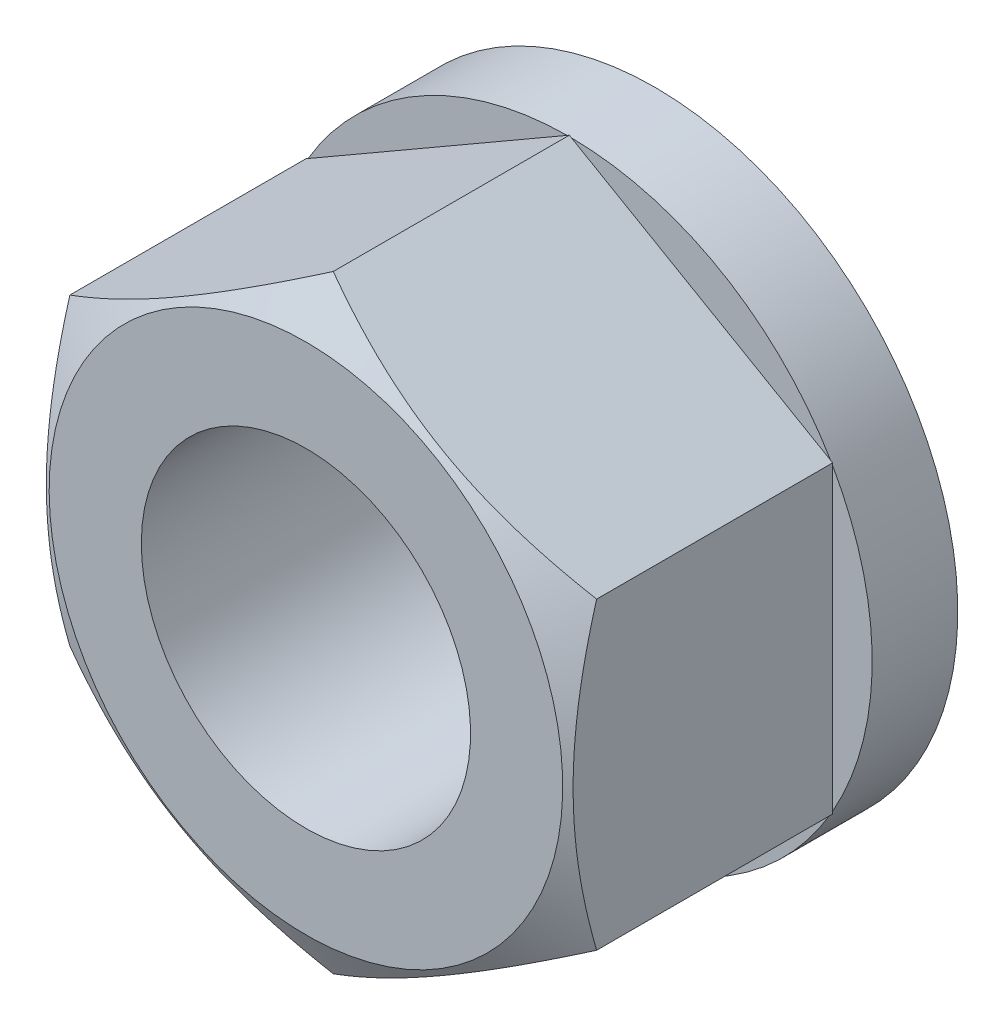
ISO-10303-21;
HEADER;
FILE_DESCRIPTION(('STEP AP214'),'2;1');
FILE_NAME('part.step','',(''),(''),'','','');
FILE_SCHEMA(('AUTOMOTIVE_DESIGN { 1 0 10303 214 1 1 1 1 }'));
ENDSEC;
DATA;
#1=APPLICATION_CONTEXT('core data for automotive mechanical design processes');
#2=APPLICATION_PROTOCOL_DEFINITION('international standard','automotive_design',2000,#1);
#3=PRODUCT_CONTEXT('',#1,'mechanical');
#4=PRODUCT('Part','Part','',(#3));
#5=PRODUCT_RELATED_PRODUCT_CATEGORY('part','',(#4));
#6=PRODUCT_DEFINITION_FORMATION('','',#4);
#7=PRODUCT_DEFINITION_CONTEXT('part definition',#1,'design');
#8=PRODUCT_DEFINITION('design','',#6,#7);
#9=PRODUCT_DEFINITION_SHAPE('','',#8);
#10=(LENGTH_UNIT() NAMED_UNIT(*) SI_UNIT(.MILLI.,.METRE.));
#11=(NAMED_UNIT(*) PLANE_ANGLE_UNIT() SI_UNIT($,.RADIAN.));
#12=(NAMED_UNIT(*) SI_UNIT($,.STERADIAN.) SOLID_ANGLE_UNIT());
#13=UNCERTAINTY_MEASURE_WITH_UNIT(LENGTH_MEASURE(1.E-05),#10,'distance_accuracy_value','');
#14=(GEOMETRIC_REPRESENTATION_CONTEXT(3) GLOBAL_UNCERTAINTY_ASSIGNED_CONTEXT((#13)) GLOBAL_UNIT_ASSIGNED_CONTEXT((#10,
#11,#12)) REPRESENTATION_CONTEXT('',''));
#15=CARTESIAN_POINT('',(0.,0.,0.));
#16=DIRECTION('',(0.,0.,1.));
#17=DIRECTION('',(1.,0.,0.));
#18=AXIS2_PLACEMENT_3D('',#15,#16,#17);
#19=CARTESIAN_POINT('',(0.,0.,1.3));
#20=DIRECTION('',(0.,0.,1.));
#21=DIRECTION('',(0.866025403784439,-0.5,0.));
#22=AXIS2_PLACEMENT_3D('',#19,#20,#21);
#23=PLANE('',#22);
#24=DIRECTION('',(0.866025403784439,0.5,0.));
#25=VECTOR('',#24,1.);
#26=CARTESIAN_POINT('',(0.,-4.61880215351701,1.3));
#27=LINE('',#26,#25);
#28=CARTESIAN_POINT('',(0.0327684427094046,-4.59988328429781,1.3));
#29=VERTEX_POINT('',#28);
#30=CARTESIAN_POINT('',(3.9672315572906,-2.3283199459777,1.3));
#31=VERTEX_POINT('',#30);
#32=EDGE_CURVE('E28',#29,#31,#27,.T.);
#33=ORIENTED_EDGE('',*,*,#32,.F.);
#34=CARTESIAN_POINT('',(0.,0.,1.3));
#35=DIRECTION('',(0.,0.,1.));
#36=DIRECTION('',(0.866025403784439,-0.5,0.));
#37=AXIS2_PLACEMENT_3D('',#34,#35,#36);
#38=CIRCLE('',#37,4.6);
#39=EDGE_CURVE('E163',#29,#31,#38,.T.);
#40=ORIENTED_EDGE('',*,*,#39,.T.);
#41=EDGE_LOOP('',(#33,#40));
#42=FACE_BOUND('',#41,.T.);
#43=ADVANCED_FACE('F14',(#42),#23,.T.);
#44=DIRECTION('',(0.866025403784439,-0.5,0.));
#45=VECTOR('',#44,1.);
#46=CARTESIAN_POINT('',(-4.,-2.3094010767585,1.3));
#47=LINE('',#46,#45);
#48=CARTESIAN_POINT('',(-3.9672315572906,-2.3283199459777,1.3));
#49=VERTEX_POINT('',#48);
#50=CARTESIAN_POINT('',(-0.0327684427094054,-4.59988328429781,1.3));
#51=VERTEX_POINT('',#50);
#52=EDGE_CURVE('E137',#49,#51,#47,.T.);
#53=ORIENTED_EDGE('',*,*,#52,.F.);
#54=EDGE_CURVE('E171',#49,#51,#38,.T.);
#55=ORIENTED_EDGE('',*,*,#54,.T.);
#56=EDGE_LOOP('',(#53,#55));
#57=FACE_BOUND('',#56,.T.);
#58=ADVANCED_FACE('F299',(#57),#23,.T.);
#59=DIRECTION('',(0.,-1.,0.));
#60=VECTOR('',#59,1.);
#61=CARTESIAN_POINT('',(-4.,2.30940107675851,1.3));
#62=LINE('',#61,#60);
#63=CARTESIAN_POINT('',(-4.,2.2715633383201,1.3));
#64=VERTEX_POINT('',#63);
#65=CARTESIAN_POINT('',(-4.,-2.2715633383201,1.3));
#66=VERTEX_POINT('',#65);
#67=EDGE_CURVE('E219',#64,#66,#62,.T.);
#68=ORIENTED_EDGE('',*,*,#67,.F.);
#69=EDGE_CURVE('E178',#64,#66,#38,.T.);
#70=ORIENTED_EDGE('',*,*,#69,.T.);
#71=EDGE_LOOP('',(#68,#70));
#72=FACE_BOUND('',#71,.T.);
#73=ADVANCED_FACE('F305',(#72),#23,.T.);
#74=DIRECTION('',(-0.866025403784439,-0.5,0.));
#75=VECTOR('',#74,1.);
#76=CARTESIAN_POINT('',(0.,4.61880215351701,1.3));
#77=LINE('',#76,#75);
#78=CARTESIAN_POINT('',(-0.0327684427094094,4.59988328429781,1.3));
#79=VERTEX_POINT('',#78);
#80=CARTESIAN_POINT('',(-3.9672315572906,2.3283199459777,1.3));
#81=VERTEX_POINT('',#80);
#82=EDGE_CURVE('E217',#79,#81,#77,.T.);
#83=ORIENTED_EDGE('',*,*,#82,.F.);
#84=EDGE_CURVE('E187',#79,#81,#38,.T.);
#85=ORIENTED_EDGE('',*,*,#84,.T.);
#86=EDGE_LOOP('',(#83,#85));
#87=FACE_BOUND('',#86,.T.);
#88=ADVANCED_FACE('F315',(#87),#23,.T.);
#89=DIRECTION('',(-0.866025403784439,0.5,0.));
#90=VECTOR('',#89,1.);
#91=CARTESIAN_POINT('',(4.,2.3094010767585,1.3));
#92=LINE('',#91,#90);
#93=CARTESIAN_POINT('',(3.9672315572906,2.3283199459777,1.3));
#94=VERTEX_POINT('',#93);
#95=CARTESIAN_POINT('',(0.0327684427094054,4.59988328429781,1.3));
#96=VERTEX_POINT('',#95);
#97=EDGE_CURVE('E157',#94,#96,#92,.T.);
#98=ORIENTED_EDGE('',*,*,#97,.F.);
#99=EDGE_CURVE('E162',#94,#96,#38,.T.);
#100=ORIENTED_EDGE('',*,*,#99,.T.);
#101=EDGE_LOOP('',(#98,#100));
#102=FACE_BOUND('',#101,.T.);
#103=ADVANCED_FACE('F204',(#102),#23,.T.);
#104=DIRECTION('',(0.,1.,0.));
#105=VECTOR('',#104,1.);
#106=CARTESIAN_POINT('',(4.,-2.30940107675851,1.3));
#107=LINE('',#106,#105);
#108=CARTESIAN_POINT('',(4.,-2.27156333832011,1.3));
#109=VERTEX_POINT('',#108);
#110=CARTESIAN_POINT('',(4.,2.2715633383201,1.3));
#111=VERTEX_POINT('',#110);
#112=EDGE_CURVE('E152',#109,#111,#107,.T.);
#113=ORIENTED_EDGE('',*,*,#112,.F.);
#114=EDGE_CURVE('E151',#109,#111,#38,.T.);
#115=ORIENTED_EDGE('',*,*,#114,.T.);
#116=EDGE_LOOP('',(#113,#115));
#117=FACE_BOUND('',#116,.T.);
#118=ADVANCED_FACE('F300',(#117),#23,.T.);
#119=CARTESIAN_POINT('',(0.,0.,0.));
#120=DIRECTION('',(0.,0.,1.));
#121=DIRECTION('',(0.866025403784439,-0.5,0.));
#122=AXIS2_PLACEMENT_3D('',#119,#120,#121);
#123=PLANE('',#122);
#124=CARTESIAN_POINT('',(0.,0.,0.));
#125=DIRECTION('',(0.,0.,1.));
#126=DIRECTION('',(0.866025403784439,-0.5,0.));
#127=AXIS2_PLACEMENT_3D('',#124,#125,#126);
#128=CIRCLE('',#127,4.6);
#129=CARTESIAN_POINT('',(3.98371685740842,-2.3,0.));
#130=VERTEX_POINT('',#129);
#131=EDGE_CURVE('E149',#130,#130,#128,.T.);
#132=ORIENTED_EDGE('',*,*,#131,.F.);
#133=EDGE_LOOP('',(#132));
#134=FACE_BOUND('',#133,.T.);
#135=CARTESIAN_POINT('',(0.,0.,0.));
#136=DIRECTION('',(0.,0.,1.));
#137=DIRECTION('',(0.866025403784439,-0.5,0.));
#138=AXIS2_PLACEMENT_3D('',#135,#136,#137);
#139=CIRCLE('',#138,2.5);
#140=CARTESIAN_POINT('',(2.1650635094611,-1.25,0.));
#141=VERTEX_POINT('',#140);
#142=EDGE_CURVE('E146',#141,#141,#139,.T.);
#143=ORIENTED_EDGE('',*,*,#142,.T.);
#144=EDGE_LOOP('',(#143));
#145=FACE_BOUND('',#144,.T.);
#146=ADVANCED_FACE('F308',(#134,#145),#123,.F.);
#147=CARTESIAN_POINT('',(0.,0.,1.3));
#148=DIRECTION('',(0.,0.,-1.));
#149=DIRECTION('',(-0.866025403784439,0.5,0.));
#150=AXIS2_PLACEMENT_3D('',#147,#148,#149);
#151=CYLINDRICAL_SURFACE('',#150,4.6);
#152=ORIENTED_EDGE('',*,*,#114,.F.);
#153=EDGE_CURVE('E42',#31,#109,#38,.T.);
#154=ORIENTED_EDGE('',*,*,#153,.F.);
#155=ORIENTED_EDGE('',*,*,#39,.F.);
#156=EDGE_CURVE('E168',#51,#29,#38,.T.);
#157=ORIENTED_EDGE('',*,*,#156,.F.);
#158=ORIENTED_EDGE('',*,*,#54,.F.);
#159=EDGE_CURVE('E174',#66,#49,#38,.T.);
#160=ORIENTED_EDGE('',*,*,#159,.F.);
#161=ORIENTED_EDGE('',*,*,#69,.F.);
#162=EDGE_CURVE('E183',#81,#64,#38,.T.);
#163=ORIENTED_EDGE('',*,*,#162,.F.);
#164=ORIENTED_EDGE('',*,*,#84,.F.);
#165=EDGE_CURVE('E193',#96,#79,#38,.T.);
#166=ORIENTED_EDGE('',*,*,#165,.F.);
#167=ORIENTED_EDGE('',*,*,#99,.F.);
#168=EDGE_CURVE('E153',#111,#94,#38,.T.);
#169=ORIENTED_EDGE('',*,*,#168,.F.);
#170=EDGE_LOOP('',(#152,#154,#155,#157,#158,#160,#161,#163,#164,#166,#167,#169));
#171=FACE_BOUND('',#170,.T.);
#172=ORIENTED_EDGE('',*,*,#131,.T.);
#173=EDGE_LOOP('',(#172));
#174=FACE_BOUND('',#173,.T.);
#175=ADVANCED_FACE('F16',(#171,#174),#151,.T.);
#176=CARTESIAN_POINT('',(0.,0.,1.3));
#177=DIRECTION('',(0.,0.,-1.));
#178=DIRECTION('',(-0.866025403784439,0.5,0.));
#179=AXIS2_PLACEMENT_3D('',#176,#177,#178);
#180=CYLINDRICAL_SURFACE('',#179,2.5);
#181=ORIENTED_EDGE('',*,*,#142,.F.);
#182=EDGE_LOOP('',(#181));
#183=FACE_BOUND('',#182,.T.);
#184=CARTESIAN_POINT('',(0.,0.,5.3));
#185=DIRECTION('',(0.,0.,1.));
#186=DIRECTION('',(0.866025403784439,-0.5,0.));
#187=AXIS2_PLACEMENT_3D('',#184,#185,#186);
#188=CIRCLE('',#187,2.5);
#189=CARTESIAN_POINT('',(2.1650635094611,-1.25,5.3));
#190=VERTEX_POINT('',#189);
#191=EDGE_CURVE('E122',#190,#190,#188,.T.);
#192=ORIENTED_EDGE('',*,*,#191,.T.);
#193=EDGE_LOOP('',(#192));
#194=FACE_BOUND('',#193,.T.);
#195=ADVANCED_FACE('F330',(#183,#194),#180,.F.);
#196=CARTESIAN_POINT('',(0.,-4.61880215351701,1.3));
#197=DIRECTION('',(0.,0.,-1.));
#198=DIRECTION('',(-0.866025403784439,0.5,0.));
#199=AXIS2_PLACEMENT_3D('',#196,#197,#198);
#200=PLANE('',#199);
#201=CARTESIAN_POINT('',(4.,2.3094010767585,1.3));
#202=VERTEX_POINT('',#201);
#203=EDGE_CURVE('E160',#111,#202,#107,.T.);
#204=ORIENTED_EDGE('',*,*,#203,.F.);
#205=ORIENTED_EDGE('',*,*,#168,.T.);
#206=EDGE_CURVE('E212',#202,#94,#92,.T.);
#207=ORIENTED_EDGE('',*,*,#206,.F.);
#208=EDGE_LOOP('',(#204,#205,#207));
#209=FACE_BOUND('',#208,.T.);
#210=ADVANCED_FACE('F320',(#209),#200,.T.);
#211=CARTESIAN_POINT('',(0.,4.61880215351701,1.3));
#212=VERTEX_POINT('',#211);
#213=EDGE_CURVE('E207',#96,#212,#92,.T.);
#214=ORIENTED_EDGE('',*,*,#213,.F.);
#215=ORIENTED_EDGE('',*,*,#165,.T.);
#216=EDGE_CURVE('E209',#212,#79,#77,.T.);
#217=ORIENTED_EDGE('',*,*,#216,.F.);
#218=EDGE_LOOP('',(#214,#215,#217));
#219=FACE_BOUND('',#218,.T.);
#220=ADVANCED_FACE('F208',(#219),#200,.T.);
#221=CARTESIAN_POINT('',(-4.,2.30940107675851,1.3));
#222=VERTEX_POINT('',#221);
#223=EDGE_CURVE('E221',#81,#222,#77,.T.);
#224=ORIENTED_EDGE('',*,*,#223,.F.);
#225=ORIENTED_EDGE('',*,*,#162,.T.);
#226=EDGE_CURVE('E226',#222,#64,#62,.T.);
#227=ORIENTED_EDGE('',*,*,#226,.F.);
#228=EDGE_LOOP('',(#224,#225,#227));
#229=FACE_BOUND('',#228,.T.);
#230=ADVANCED_FACE('F337',(#229),#200,.T.);
#231=CARTESIAN_POINT('',(-4.,-2.3094010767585,1.3));
#232=VERTEX_POINT('',#231);
#233=EDGE_CURVE('E225',#66,#232,#62,.T.);
#234=ORIENTED_EDGE('',*,*,#233,.F.);
#235=ORIENTED_EDGE('',*,*,#159,.T.);
#236=EDGE_CURVE('E131',#232,#49,#47,.T.);
#237=ORIENTED_EDGE('',*,*,#236,.F.);
#238=EDGE_LOOP('',(#234,#235,#237));
#239=FACE_BOUND('',#238,.T.);
#240=ADVANCED_FACE('F332',(#239),#200,.T.);
#241=CARTESIAN_POINT('',(0.,-4.61880215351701,1.3));
#242=VERTEX_POINT('',#241);
#243=EDGE_CURVE('E128',#51,#242,#47,.T.);
#244=ORIENTED_EDGE('',*,*,#243,.F.);
#245=ORIENTED_EDGE('',*,*,#156,.T.);
#246=EDGE_CURVE('E232',#242,#29,#27,.T.);
#247=ORIENTED_EDGE('',*,*,#246,.F.);
#248=EDGE_LOOP('',(#244,#245,#247));
#249=FACE_BOUND('',#248,.T.);
#250=ADVANCED_FACE('F323',(#249),#200,.T.);
#251=CARTESIAN_POINT('',(0.,-4.61880215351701,5.3));
#252=DIRECTION('',(0.,0.,-1.));
#253=DIRECTION('',(-0.866025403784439,0.5,0.));
#254=AXIS2_PLACEMENT_3D('',#251,#252,#253);
#255=PLANE('',#254);
#256=CARTESIAN_POINT('',(0.,0.,5.3));
#257=DIRECTION('',(0.,0.,-1.));
#258=DIRECTION('',(-0.866025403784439,0.5,0.));
#259=AXIS2_PLACEMENT_3D('',#256,#257,#258);
#260=CIRCLE('',#259,3.9);
#261=CARTESIAN_POINT('',(-3.37749907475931,1.95,5.3));
#262=VERTEX_POINT('',#261);
#263=EDGE_CURVE('E343',#262,#262,#260,.T.);
#264=ORIENTED_EDGE('',*,*,#263,.F.);
#265=EDGE_LOOP('',(#264));
#266=FACE_BOUND('',#265,.T.);
#267=ORIENTED_EDGE('',*,*,#191,.F.);
#268=EDGE_LOOP('',(#267));
#269=FACE_BOUND('',#268,.T.);
#270=ADVANCED_FACE('F322',(#266,#269),#255,.F.);
#271=CARTESIAN_POINT('',(4.,-2.30940107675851,1.3));
#272=VERTEX_POINT('',#271);
#273=EDGE_CURVE('E233',#31,#272,#27,.T.);
#274=ORIENTED_EDGE('',*,*,#273,.F.);
#275=ORIENTED_EDGE('',*,*,#153,.T.);
#276=EDGE_CURVE('E159',#272,#109,#107,.T.);
#277=ORIENTED_EDGE('',*,*,#276,.F.);
#278=EDGE_LOOP('',(#274,#275,#277));
#279=FACE_BOUND('',#278,.T.);
#280=ADVANCED_FACE('F256',(#279),#200,.T.);
#281=CARTESIAN_POINT('',(0.,-4.61880215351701,5.3));
#282=DIRECTION('',(-0.5,0.866025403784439,0.));
#283=DIRECTION('',(-0.866025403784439,-0.5,0.));
#284=AXIS2_PLACEMENT_3D('',#281,#282,#283);
#285=PLANE('',#284);
#286=DIRECTION('',(0.,0.,-1.));
#287=VECTOR('',#286,1.);
#288=CARTESIAN_POINT('',(4.,-2.30940107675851,5.3));
#289=LINE('',#288,#287);
#290=CARTESIAN_POINT('',(4.,-2.30940107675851,4.88499938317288));
#291=VERTEX_POINT('',#290);
#292=EDGE_CURVE('E121',#291,#272,#289,.T.);
#293=ORIENTED_EDGE('',*,*,#292,.F.);
#294=CARTESIAN_POINT('',(4.0002,-2.30928560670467,4.88493271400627));
#295=CARTESIAN_POINT('',(3.82442084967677,-2.41077174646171,4.94354709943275));
#296=CARTESIAN_POINT('',(3.64712438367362,-2.513133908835,4.99685465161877));
#297=CARTESIAN_POINT('',(3.28946140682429,-2.71963072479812,5.08990330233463));
#298=CARTESIAN_POINT('',(3.10908854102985,-2.82376904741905,5.12961148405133));
#299=CARTESIAN_POINT('',(2.75057818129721,-3.03075510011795,5.19142275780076));
#300=CARTESIAN_POINT('',(2.57249584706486,-3.13357098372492,5.21393724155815));
#301=CARTESIAN_POINT('',(2.21549328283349,-3.33968651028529,5.24081434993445));
#302=CARTESIAN_POINT('',(2.0365743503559,-3.44298540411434,5.24519923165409));
#303=CARTESIAN_POINT('',(1.70225715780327,-3.63600352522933,5.23607490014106));
#304=CARTESIAN_POINT('',(1.54680884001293,-3.72575165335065,5.22480601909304));
#305=CARTESIAN_POINT('',(1.23692494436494,-3.90466320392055,5.18909098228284));
#306=CARTESIAN_POINT('',(1.08249043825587,-3.99382600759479,5.1646326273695));
#307=CARTESIAN_POINT('',(0.771967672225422,-4.17310641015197,5.10348890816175));
#308=CARTESIAN_POINT('',(0.615918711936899,-4.26320131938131,5.06654436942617));
#309=CARTESIAN_POINT('',(0.306148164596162,-4.44204742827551,4.98269490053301));
#310=CARTESIAN_POINT('',(0.152422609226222,-4.53080091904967,4.9358096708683));
#311=CARTESIAN_POINT('',(-0.000199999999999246,-4.61891762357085,4.88493271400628));
#312=B_SPLINE_CURVE_WITH_KNOTS('',3,(#294,#295,#296,#297,#298,#299,#300,#301,#302,#303,#304,
#305,#306,#307,#308,#309,#310,#311),.UNSPECIFIED.,.F.,.F.,(4,2,2,2,2,2,2,2,4),(0.,
0.634047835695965,1.26961969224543,1.88946157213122,2.50854226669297,3.04757825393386,
3.58711366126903,4.13861653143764,4.68903648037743),.UNSPECIFIED.);
#313=CARTESIAN_POINT('',(0.,-4.61880215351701,4.88499938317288));
#314=VERTEX_POINT('',#313);
#315=EDGE_CURVE('E109',#291,#314,#312,.T.);
#316=ORIENTED_EDGE('',*,*,#315,.T.);
#317=DIRECTION('',(0.,0.,-1.));
#318=VECTOR('',#317,1.);
#319=CARTESIAN_POINT('',(0.,-4.61880215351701,5.3));
#320=LINE('',#319,#318);
#321=EDGE_CURVE('E118',#314,#242,#320,.T.);
#322=ORIENTED_EDGE('',*,*,#321,.T.);
#323=ORIENTED_EDGE('',*,*,#246,.T.);
#324=ORIENTED_EDGE('',*,*,#32,.T.);
#325=ORIENTED_EDGE('',*,*,#273,.T.);
#326=EDGE_LOOP('',(#293,#316,#322,#323,#324,#325));
#327=FACE_BOUND('',#326,.T.);
#328=ADVANCED_FACE('F116',(#327),#285,.F.);
#329=CARTESIAN_POINT('',(4.,-2.30940107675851,5.3));
#330=DIRECTION('',(-1.,0.,0.));
#331=DIRECTION('',(0.,-1.,0.));
#332=AXIS2_PLACEMENT_3D('',#329,#330,#331);
#333=PLANE('',#332);
#334=DIRECTION('',(0.,0.,-1.));
#335=VECTOR('',#334,1.);
#336=CARTESIAN_POINT('',(4.,2.3094010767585,5.3));
#337=LINE('',#336,#335);
#338=CARTESIAN_POINT('',(4.,2.3094010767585,4.88499938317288));
#339=VERTEX_POINT('',#338);
#340=EDGE_CURVE('E143',#339,#202,#337,.T.);
#341=ORIENTED_EDGE('',*,*,#340,.F.);
#342=CARTESIAN_POINT('',(4.,2.30963201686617,4.88493271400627));
#343=CARTESIAN_POINT('',(4.,2.1066597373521,4.94354709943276));
#344=CARTESIAN_POINT('',(4.,1.90193541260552,4.99685465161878));
#345=CARTESIAN_POINT('',(4.,1.48894178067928,5.08990330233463));
#346=CARTESIAN_POINT('',(4.,1.28066513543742,5.12961148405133));
#347=CARTESIAN_POINT('',(4.,0.866693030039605,5.19142275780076));
#348=CARTESIAN_POINT('',(4.,0.661061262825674,5.21393724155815));
#349=CARTESIAN_POINT('',(4.,0.248830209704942,5.24081434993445));
#350=CARTESIAN_POINT('',(4.,0.042232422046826,5.24519923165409));
#351=CARTESIAN_POINT('',(4.,-0.343803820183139,5.23607490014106));
#352=CARTESIAN_POINT('',(4.,-0.523300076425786,5.22480601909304));
#353=CARTESIAN_POINT('',(4.,-0.881123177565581,5.18909098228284));
#354=CARTESIAN_POINT('',(4.,-1.05944878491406,5.1646326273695));
#355=CARTESIAN_POINT('',(4.,-1.41800959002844,5.10348890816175));
#356=CARTESIAN_POINT('',(4.,-1.59819940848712,5.06654436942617));
#357=CARTESIAN_POINT('',(4.,-1.9558916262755,4.98269490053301));
#358=CARTESIAN_POINT('',(4.,-2.13339860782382,4.9358096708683));
#359=CARTESIAN_POINT('',(4.,-2.30963201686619,4.88493271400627));
#360=B_SPLINE_CURVE_WITH_KNOTS('',3,(#342,#343,#344,#345,#346,#347,#348,#349,#350,#351,#352,
#353,#354,#355,#356,#357,#358,#359),.UNSPECIFIED.,.F.,.F.,(4,2,2,2,2,2,2,2,4),(0.,
0.634047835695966,1.26961969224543,1.88946157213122,2.50854226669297,3.04757825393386,
3.58711366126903,4.13861653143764,4.68903648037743),.UNSPECIFIED.);
#361=EDGE_CURVE('E123',#339,#291,#360,.T.);
#362=ORIENTED_EDGE('',*,*,#361,.T.);
#363=ORIENTED_EDGE('',*,*,#292,.T.);
#364=ORIENTED_EDGE('',*,*,#276,.T.);
#365=ORIENTED_EDGE('',*,*,#112,.T.);
#366=ORIENTED_EDGE('',*,*,#203,.T.);
#367=EDGE_LOOP('',(#341,#362,#363,#364,#365,#366));
#368=FACE_BOUND('',#367,.T.);
#369=ADVANCED_FACE('F287',(#368),#333,.F.);
#370=CARTESIAN_POINT('',(4.,2.3094010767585,5.3));
#371=DIRECTION('',(-0.5,-0.866025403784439,0.));
#372=DIRECTION('',(0.866025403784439,-0.5,0.));
#373=AXIS2_PLACEMENT_3D('',#370,#371,#372);
#374=PLANE('',#373);
#375=DIRECTION('',(0.,0.,-1.));
#376=VECTOR('',#375,1.);
#377=CARTESIAN_POINT('',(0.,4.61880215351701,5.3));
#378=LINE('',#377,#376);
#379=CARTESIAN_POINT('',(0.,4.61880215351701,4.88499938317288));
#380=VERTEX_POINT('',#379);
#381=EDGE_CURVE('E141',#380,#212,#378,.T.);
#382=ORIENTED_EDGE('',*,*,#381,.F.);
#383=CARTESIAN_POINT('',(-3.34244729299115,6.54856499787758,3.30683949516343));
#384=CARTESIAN_POINT('',(-3.1913946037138,6.46135468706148,3.39131019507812));
#385=CARTESIAN_POINT('',(-3.0399919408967,6.37394231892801,3.47496093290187));
#386=CARTESIAN_POINT('',(-2.73630043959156,6.19860594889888,3.64016061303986));
#387=CARTESIAN_POINT('',(-2.58401146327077,6.11068186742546,3.72170921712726));
#388=CARTESIAN_POINT('',(-2.27756206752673,5.93375322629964,3.88266042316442));
#389=CARTESIAN_POINT('',(-2.1233959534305,5.84474537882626,3.96204861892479));
#390=CARTESIAN_POINT('',(-1.81382705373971,5.66601569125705,4.11752984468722));
#391=CARTESIAN_POINT('',(-1.65842432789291,5.5762938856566,4.19362303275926));
#392=CARTESIAN_POINT('',(-1.3412351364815,5.39316462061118,4.34396563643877));
#393=CARTESIAN_POINT('',(-1.17940127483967,5.29972979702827,4.41808246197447));
#394=CARTESIAN_POINT('',(-0.853829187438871,5.11176066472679,4.56062285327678));
#395=CARTESIAN_POINT('',(-0.690090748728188,5.01722623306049,4.62904577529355));
#396=CARTESIAN_POINT('',(-0.360765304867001,4.82709009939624,4.75837687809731));
#397=CARTESIAN_POINT('',(-0.195182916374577,4.73149106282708,4.81930057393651));
#398=CARTESIAN_POINT('',(0.138356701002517,4.53892187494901,4.93165556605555));
#399=CARTESIAN_POINT('',(0.306313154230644,4.44195217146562,4.98308988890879));
#400=CARTESIAN_POINT('',(0.643769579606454,4.24712161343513,5.07370349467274));
#401=CARTESIAN_POINT('',(0.813256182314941,4.14926847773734,5.11294793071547));
#402=CARTESIAN_POINT('',(1.15430550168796,3.95236356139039,5.17693978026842));
#403=CARTESIAN_POINT('',(1.32586802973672,3.85331188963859,5.20168850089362));
#404=CARTESIAN_POINT('',(1.66798404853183,3.65579111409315,5.23438992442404));
#405=CARTESIAN_POINT('',(1.83852187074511,3.5573310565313,5.24255581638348));
#406=CARTESIAN_POINT('',(2.17958815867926,3.36041634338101,5.24195835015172));
#407=CARTESIAN_POINT('',(2.35011662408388,3.26196168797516,5.23319459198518));
#408=CARTESIAN_POINT('',(2.64051618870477,3.09429942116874,5.20446987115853));
#409=CARTESIAN_POINT('',(2.76070103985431,3.02491066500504,5.18850506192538));
#410=CARTESIAN_POINT('',(3.00016600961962,2.88665550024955,5.1491789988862));
#411=CARTESIAN_POINT('',(3.11944599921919,2.8177891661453,5.1258167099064));
#412=CARTESIAN_POINT('',(3.47578398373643,2.61205733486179,5.04586462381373));
#413=CARTESIAN_POINT('',(3.711201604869,2.47613890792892,4.97942508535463));
#414=CARTESIAN_POINT('',(4.06317453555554,2.27292724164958,4.8645849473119));
#415=CARTESIAN_POINT('',(4.18156232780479,2.20457601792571,4.82324950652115));
#416=CARTESIAN_POINT('',(4.41718730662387,2.06853787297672,4.73637752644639));
#417=CARTESIAN_POINT('',(4.53442448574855,2.00085095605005,4.69084095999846));
#418=CARTESIAN_POINT('',(4.76778694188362,1.86611907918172,4.59628978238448));
#419=CARTESIAN_POINT('',(4.88391258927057,1.79907390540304,4.54727637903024));
#420=CARTESIAN_POINT('',(5.11520717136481,1.66553591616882,4.44633894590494));
#421=CARTESIAN_POINT('',(5.2303761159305,1.59904309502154,4.39441494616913));
#422=CARTESIAN_POINT('',(5.49651097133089,1.44539006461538,4.27117055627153));
#423=CARTESIAN_POINT('',(5.64716398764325,1.35841050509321,4.19895108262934));
#424=CARTESIAN_POINT('',(5.94723552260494,1.18516412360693,4.05116104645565));
#425=CARTESIAN_POINT('',(6.09665397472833,1.0988973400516,3.9755903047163));
#426=CARTESIAN_POINT('',(6.39447671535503,0.926949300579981,3.82175337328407));
#427=CARTESIAN_POINT('',(6.54288081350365,0.841268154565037,3.74348669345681));
#428=CARTESIAN_POINT('',(6.83881572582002,0.670410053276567,3.58477899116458));
#429=CARTESIAN_POINT('',(6.98634652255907,0.585233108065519,3.50433792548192));
#430=CARTESIAN_POINT('',(7.4281125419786,0.330179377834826,3.26022234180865));
#431=CARTESIAN_POINT('',(7.72124900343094,0.160936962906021,3.09389801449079));
#432=CARTESIAN_POINT('',(8.30542978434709,-0.176339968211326,2.75642249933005));
#433=CARTESIAN_POINT('',(8.59647403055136,-0.344374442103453,2.58527114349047));
#434=CARTESIAN_POINT('',(9.15359401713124,-0.666027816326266,2.25346688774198));
#435=CARTESIAN_POINT('',(9.41978938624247,-0.819715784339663,2.0930813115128));
#436=CARTESIAN_POINT('',(9.9511851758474,-1.1265172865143,1.77010727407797));
#437=CARTESIAN_POINT('',(10.2163855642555,-1.27963080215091,1.60751874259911));
#438=CARTESIAN_POINT('',(10.7453874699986,-1.58505019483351,1.2810364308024));
#439=CARTESIAN_POINT('',(11.0091908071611,-1.73735712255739,1.11714657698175));
#440=CARTESIAN_POINT('',(11.5361578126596,-2.04160166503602,0.788038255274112));
#441=CARTESIAN_POINT('',(11.799321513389,-2.1935392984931,0.622819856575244));
#442=CARTESIAN_POINT('',(12.0622481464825,-2.34534006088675,0.45710356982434));
#443=B_SPLINE_CURVE_WITH_KNOTS('',3,(#383,#384,#385,#386,#387,#388,#389,#390,#391,#392,#393,
#394,#395,#396,#397,#398,#399,#400,#401,#402,#403,#404,#405,#406,#407,#408,#409,#410,#411,#412,
#413,#414,#415,#416,#417,#418,#419,#420,#421,#422,#423,#424,#425,#426,#427,#428,#429,#430,#431,
#432,#433,#434,#435,#436,#437,#438,#439,#440,#441,#442),.UNSPECIFIED.,.F.,.F.,(4,2,2,2,2,2,2,2,
2,2,2,2,2,2,2,2,2,2,2,2,2,2,2,2,2,2,2,2,2,4),(0.,0.581402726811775,1.16289842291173,
1.74761836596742,2.33231022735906,2.93533232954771,3.53842251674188,4.14024322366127,
4.74187165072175,5.34022681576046,5.93852801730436,6.52908747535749,7.11966088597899,
7.53853533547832,7.95746842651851,8.7958140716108,9.2242245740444,9.65263784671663,
10.0809030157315,10.5091637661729,11.074180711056,11.6392279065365,12.2043783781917,
12.7695400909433,13.9008992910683,15.0322979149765,16.0723974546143,17.1125302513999,
18.1502382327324,19.187892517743),.UNSPECIFIED.);
#444=EDGE_CURVE('E277',#380,#339,#443,.T.);
#445=ORIENTED_EDGE('',*,*,#444,.T.);
#446=ORIENTED_EDGE('',*,*,#340,.T.);
#447=ORIENTED_EDGE('',*,*,#206,.T.);
#448=ORIENTED_EDGE('',*,*,#97,.T.);
#449=ORIENTED_EDGE('',*,*,#213,.T.);
#450=EDGE_LOOP('',(#382,#445,#446,#447,#448,#449));
#451=FACE_BOUND('',#450,.T.);
#452=ADVANCED_FACE('F215',(#451),#374,.F.);
#453=CARTESIAN_POINT('',(0.,4.61880215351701,5.3));
#454=DIRECTION('',(0.5,-0.866025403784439,0.));
#455=DIRECTION('',(0.866025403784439,0.5,0.));
#456=AXIS2_PLACEMENT_3D('',#453,#454,#455);
#457=PLANE('',#456);
#458=DIRECTION('',(0.,0.,-1.));
#459=VECTOR('',#458,1.);
#460=CARTESIAN_POINT('',(-4.,2.30940107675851,5.3));
#461=LINE('',#460,#459);
#462=CARTESIAN_POINT('',(-4.,2.30940107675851,4.88499938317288));
#463=VERTEX_POINT('',#462);
#464=EDGE_CURVE('E133',#463,#222,#461,.T.);
#465=ORIENTED_EDGE('',*,*,#464,.F.);
#466=CARTESIAN_POINT('',(-4.0002,2.30928560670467,4.88493271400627));
#467=CARTESIAN_POINT('',(-3.82442084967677,2.41077174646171,4.94354709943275));
#468=CARTESIAN_POINT('',(-3.64712438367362,2.513133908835,4.99685465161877));
#469=CARTESIAN_POINT('',(-3.2894614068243,2.71963072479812,5.08990330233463));
#470=CARTESIAN_POINT('',(-3.10908854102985,2.82376904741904,5.12961148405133));
#471=CARTESIAN_POINT('',(-2.75057818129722,3.03075510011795,5.19142275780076));
#472=CARTESIAN_POINT('',(-2.57249584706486,3.13357098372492,5.21393724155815));
#473=CARTESIAN_POINT('',(-2.2154932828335,3.33968651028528,5.24081434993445));
#474=CARTESIAN_POINT('',(-2.0365743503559,3.44298540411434,5.24519923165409));
#475=CARTESIAN_POINT('',(-1.70225715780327,3.63600352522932,5.23607490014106));
#476=CARTESIAN_POINT('',(-1.54680884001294,3.72575165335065,5.22480601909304));
#477=CARTESIAN_POINT('',(-1.23692494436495,3.90466320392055,5.18909098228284));
#478=CARTESIAN_POINT('',(-1.08249043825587,3.99382600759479,5.1646326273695));
#479=CARTESIAN_POINT('',(-0.771967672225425,4.17310641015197,5.10348890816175));
#480=CARTESIAN_POINT('',(-0.6159187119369,4.26320131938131,5.06654436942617));
#481=CARTESIAN_POINT('',(-0.306148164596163,4.44204742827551,4.98269490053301));
#482=CARTESIAN_POINT('',(-0.152422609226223,4.53080091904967,4.9358096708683));
#483=CARTESIAN_POINT('',(0.000199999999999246,4.61891762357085,4.88493271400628));
#484=B_SPLINE_CURVE_WITH_KNOTS('',3,(#466,#467,#468,#469,#470,#471,#472,#473,#474,#475,#476,
#477,#478,#479,#480,#481,#482,#483),.UNSPECIFIED.,.F.,.F.,(4,2,2,2,2,2,2,2,4),(0.,
0.634047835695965,1.26961969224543,1.88946157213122,2.50854226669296,3.04757825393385,
3.58711366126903,4.13861653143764,4.68903648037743),.UNSPECIFIED.);
#485=EDGE_CURVE('E271',#463,#380,#484,.T.);
#486=ORIENTED_EDGE('',*,*,#485,.T.);
#487=ORIENTED_EDGE('',*,*,#381,.T.);
#488=ORIENTED_EDGE('',*,*,#216,.T.);
#489=ORIENTED_EDGE('',*,*,#82,.T.);
#490=ORIENTED_EDGE('',*,*,#223,.T.);
#491=EDGE_LOOP('',(#465,#486,#487,#488,#489,#490));
#492=FACE_BOUND('',#491,.T.);
#493=ADVANCED_FACE('F286',(#492),#457,.F.);
#494=CARTESIAN_POINT('',(-4.,2.30940107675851,5.3));
#495=DIRECTION('',(1.,0.,0.));
#496=DIRECTION('',(0.,1.,0.));
#497=AXIS2_PLACEMENT_3D('',#494,#495,#496);
#498=PLANE('',#497);
#499=DIRECTION('',(0.,0.,-1.));
#500=VECTOR('',#499,1.);
#501=CARTESIAN_POINT('',(-4.,-2.3094010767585,5.3));
#502=LINE('',#501,#500);
#503=CARTESIAN_POINT('',(-4.,-2.3094010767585,4.88499938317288));
#504=VERTEX_POINT('',#503);
#505=EDGE_CURVE('E130',#504,#232,#502,.T.);
#506=ORIENTED_EDGE('',*,*,#505,.F.);
#507=CARTESIAN_POINT('',(-4.,-2.30963201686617,4.88493271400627));
#508=CARTESIAN_POINT('',(-4.,-2.1066597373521,4.94354709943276));
#509=CARTESIAN_POINT('',(-4.,-1.90193541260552,4.99685465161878));
#510=CARTESIAN_POINT('',(-4.,-1.48894178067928,5.08990330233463));
#511=CARTESIAN_POINT('',(-4.,-1.28066513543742,5.12961148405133));
#512=CARTESIAN_POINT('',(-4.,-0.866693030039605,5.19142275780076));
#513=CARTESIAN_POINT('',(-4.,-0.661061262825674,5.21393724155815));
#514=CARTESIAN_POINT('',(-4.,-0.248830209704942,5.24081434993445));
#515=CARTESIAN_POINT('',(-4.,-0.042232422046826,5.24519923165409));
#516=CARTESIAN_POINT('',(-4.,0.343803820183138,5.23607490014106));
#517=CARTESIAN_POINT('',(-4.,0.523300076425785,5.22480601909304));
#518=CARTESIAN_POINT('',(-4.,0.881123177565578,5.18909098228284));
#519=CARTESIAN_POINT('',(-4.,1.05944878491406,5.1646326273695));
#520=CARTESIAN_POINT('',(-4.,1.41800959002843,5.10348890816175));
#521=CARTESIAN_POINT('',(-4.,1.59819940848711,5.06654436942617));
#522=CARTESIAN_POINT('',(-4.,1.9558916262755,4.98269490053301));
#523=CARTESIAN_POINT('',(-4.,2.13339860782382,4.9358096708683));
#524=CARTESIAN_POINT('',(-4.,2.30963201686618,4.88493271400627));
#525=B_SPLINE_CURVE_WITH_KNOTS('',3,(#507,#508,#509,#510,#511,#512,#513,#514,#515,#516,#517,
#518,#519,#520,#521,#522,#523,#524),.UNSPECIFIED.,.F.,.F.,(4,2,2,2,2,2,2,2,4),(0.,
0.634047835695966,1.26961969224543,1.88946157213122,2.50854226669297,3.04757825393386,
3.58711366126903,4.13861653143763,4.68903648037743),.UNSPECIFIED.);
#526=EDGE_CURVE('E35',#504,#463,#525,.T.);
#527=ORIENTED_EDGE('',*,*,#526,.T.);
#528=ORIENTED_EDGE('',*,*,#464,.T.);
#529=ORIENTED_EDGE('',*,*,#226,.T.);
#530=ORIENTED_EDGE('',*,*,#67,.T.);
#531=ORIENTED_EDGE('',*,*,#233,.T.);
#532=EDGE_LOOP('',(#506,#527,#528,#529,#530,#531));
#533=FACE_BOUND('',#532,.T.);
#534=ADVANCED_FACE('F342',(#533),#498,.F.);
#535=CARTESIAN_POINT('',(-4.,-2.3094010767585,5.3));
#536=DIRECTION('',(0.5,0.866025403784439,0.));
#537=DIRECTION('',(0.,0.,1.));
#538=AXIS2_PLACEMENT_3D('',#535,#536,#537);
#539=PLANE('',#538);
#540=ORIENTED_EDGE('',*,*,#321,.F.);
#541=CARTESIAN_POINT('',(-7.34244729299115,-0.379638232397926,3.30683949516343));
#542=CARTESIAN_POINT('',(-7.1913946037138,-0.466848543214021,3.39131019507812));
#543=CARTESIAN_POINT('',(-7.03999194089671,-0.554260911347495,3.47496093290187));
#544=CARTESIAN_POINT('',(-6.73630043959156,-0.729597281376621,3.64016061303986));
#545=CARTESIAN_POINT('',(-6.58401146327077,-0.817521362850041,3.72170921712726));
#546=CARTESIAN_POINT('',(-6.27756206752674,-0.994450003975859,3.88266042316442));
#547=CARTESIAN_POINT('',(-6.1233959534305,-1.08345785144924,3.96204861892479));
#548=CARTESIAN_POINT('',(-5.81382705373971,-1.26218753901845,4.11752984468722));
#549=CARTESIAN_POINT('',(-5.65842432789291,-1.3519093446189,4.19362303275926));
#550=CARTESIAN_POINT('',(-5.3412351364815,-1.53503860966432,4.34396563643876));
#551=CARTESIAN_POINT('',(-5.17940127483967,-1.62847343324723,4.41808246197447));
#552=CARTESIAN_POINT('',(-4.85382918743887,-1.81644256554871,4.56062285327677));
#553=CARTESIAN_POINT('',(-4.69009074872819,-1.91097699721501,4.62904577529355));
#554=CARTESIAN_POINT('',(-4.360765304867,-2.10111313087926,4.75837687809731));
#555=CARTESIAN_POINT('',(-4.19518291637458,-2.19671216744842,4.81930057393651));
#556=CARTESIAN_POINT('',(-3.86164329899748,-2.38928135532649,4.93165556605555));
#557=CARTESIAN_POINT('',(-3.69368684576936,-2.48625105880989,4.98308988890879));
#558=CARTESIAN_POINT('',(-3.35623042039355,-2.68108161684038,5.07370349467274));
#559=CARTESIAN_POINT('',(-3.18674381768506,-2.77893475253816,5.11294793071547));
#560=CARTESIAN_POINT('',(-2.84569449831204,-2.97583966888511,5.17693978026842));
#561=CARTESIAN_POINT('',(-2.67413197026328,-3.07489134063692,5.20168850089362));
#562=CARTESIAN_POINT('',(-2.33201595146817,-3.27241211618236,5.23438992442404));
#563=CARTESIAN_POINT('',(-2.16147812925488,-3.37087217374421,5.24255581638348));
#564=CARTESIAN_POINT('',(-1.82041184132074,-3.56778688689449,5.24195835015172));
#565=CARTESIAN_POINT('',(-1.64988337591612,-3.66624154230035,5.23319459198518));
#566=CARTESIAN_POINT('',(-1.35948381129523,-3.83390380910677,5.20446987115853));
#567=CARTESIAN_POINT('',(-1.23929896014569,-3.90329256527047,5.18850506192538));
#568=CARTESIAN_POINT('',(-0.999833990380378,-4.04154773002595,5.1491789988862));
#569=CARTESIAN_POINT('',(-0.880554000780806,-4.1104140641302,5.1258167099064));
#570=CARTESIAN_POINT('',(-0.524216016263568,-4.31614589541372,5.04586462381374));
#571=CARTESIAN_POINT('',(-0.288798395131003,-4.45206432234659,4.97942508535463));
#572=CARTESIAN_POINT('',(0.063174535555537,-4.65527598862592,4.86458494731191));
#573=CARTESIAN_POINT('',(0.181562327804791,-4.72362721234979,4.82324950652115));
#574=CARTESIAN_POINT('',(0.417187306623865,-4.85966535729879,4.73637752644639));
#575=CARTESIAN_POINT('',(0.534424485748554,-4.92735227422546,4.69084095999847));
#576=CARTESIAN_POINT('',(0.767786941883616,-5.06208415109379,4.59628978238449));
#577=CARTESIAN_POINT('',(0.883912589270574,-5.12912932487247,4.54727637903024));
#578=CARTESIAN_POINT('',(1.11520717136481,-5.26266731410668,4.44633894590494));
#579=CARTESIAN_POINT('',(1.2303761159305,-5.32916013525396,4.39441494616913));
#580=CARTESIAN_POINT('',(1.49651097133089,-5.48281316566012,4.27117055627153));
#581=CARTESIAN_POINT('',(1.64716398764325,-5.56979272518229,4.19895108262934));
#582=CARTESIAN_POINT('',(1.94723552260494,-5.74303910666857,4.05116104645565));
#583=CARTESIAN_POINT('',(2.09665397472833,-5.8293058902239,3.9755903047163));
#584=CARTESIAN_POINT('',(2.39447671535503,-6.00125392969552,3.82175337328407));
#585=CARTESIAN_POINT('',(2.54288081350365,-6.08693507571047,3.74348669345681));
#586=CARTESIAN_POINT('',(2.83881572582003,-6.25779317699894,3.58477899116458));
#587=CARTESIAN_POINT('',(2.98634652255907,-6.34297012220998,3.50433792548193));
#588=CARTESIAN_POINT('',(3.4281125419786,-6.59802385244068,3.26022234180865));
#589=CARTESIAN_POINT('',(3.72124900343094,-6.76726626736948,3.09389801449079));
#590=CARTESIAN_POINT('',(4.3054297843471,-7.10454319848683,2.75642249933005));
#591=CARTESIAN_POINT('',(4.59647403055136,-7.27257767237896,2.58527114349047));
#592=CARTESIAN_POINT('',(5.15359401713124,-7.59423104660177,2.25346688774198));
#593=CARTESIAN_POINT('',(5.41978938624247,-7.74791901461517,2.0930813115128));
#594=CARTESIAN_POINT('',(5.95118517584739,-8.05472051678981,1.77010727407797));
#595=CARTESIAN_POINT('',(6.21638556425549,-8.20783403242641,1.60751874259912));
#596=CARTESIAN_POINT('',(6.74538746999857,-8.51325342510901,1.2810364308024));
#597=CARTESIAN_POINT('',(7.00919080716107,-8.66556035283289,1.11714657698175));
#598=CARTESIAN_POINT('',(7.5361578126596,-8.96980489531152,0.788038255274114));
#599=CARTESIAN_POINT('',(7.79932151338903,-9.1217425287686,0.622819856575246));
#600=CARTESIAN_POINT('',(8.06224814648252,-9.27354329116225,0.457103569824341));
#601=B_SPLINE_CURVE_WITH_KNOTS('',3,(#541,#542,#543,#544,#545,#546,#547,#548,#549,#550,#551,
#552,#553,#554,#555,#556,#557,#558,#559,#560,#561,#562,#563,#564,#565,#566,#567,#568,#569,#570,
#571,#572,#573,#574,#575,#576,#577,#578,#579,#580,#581,#582,#583,#584,#585,#586,#587,#588,#589,
#590,#591,#592,#593,#594,#595,#596,#597,#598,#599,#600),.UNSPECIFIED.,.F.,.F.,(4,2,2,2,2,2,2,2,
2,2,2,2,2,2,2,2,2,2,2,2,2,2,2,2,2,2,2,2,2,4),(0.,0.581402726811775,1.16289842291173,
1.74761836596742,2.33231022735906,2.9353323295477,3.53842251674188,4.14024322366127,
4.74187165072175,5.34022681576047,5.93852801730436,6.5290874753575,7.119660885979,
7.53853533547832,7.95746842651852,8.7958140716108,9.2242245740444,9.65263784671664,
10.0809030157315,10.5091637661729,11.074180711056,11.6392279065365,12.2043783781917,
12.7695400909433,13.9008992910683,15.0322979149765,16.0723974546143,17.1125302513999,
18.1502382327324,19.187892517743),.UNSPECIFIED.);
#602=EDGE_CURVE('E9',#314,#504,#601,.F.);
#603=ORIENTED_EDGE('',*,*,#602,.T.);
#604=ORIENTED_EDGE('',*,*,#505,.T.);
#605=ORIENTED_EDGE('',*,*,#236,.T.);
#606=ORIENTED_EDGE('',*,*,#52,.T.);
#607=ORIENTED_EDGE('',*,*,#243,.T.);
#608=EDGE_LOOP('',(#540,#603,#604,#605,#606,#607));
#609=FACE_BOUND('',#608,.T.);
#610=ADVANCED_FACE('F125',(#609),#539,.F.);
#611=CARTESIAN_POINT('',(0.,0.,5.3));
#612=DIRECTION('',(0.,0.,-1.));
#613=DIRECTION('',(-0.866025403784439,0.5,0.));
#614=AXIS2_PLACEMENT_3D('',#611,#612,#613);
#615=CONICAL_SURFACE('',#614,3.9,1.0471975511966);
#616=ORIENTED_EDGE('',*,*,#263,.T.);
#617=EDGE_LOOP('',(#616));
#618=FACE_BOUND('',#617,.T.);
#619=ORIENTED_EDGE('',*,*,#361,.F.);
#620=ORIENTED_EDGE('',*,*,#444,.F.);
#621=ORIENTED_EDGE('',*,*,#485,.F.);
#622=ORIENTED_EDGE('',*,*,#526,.F.);
#623=ORIENTED_EDGE('',*,*,#602,.F.);
#624=ORIENTED_EDGE('',*,*,#315,.F.);
#625=EDGE_LOOP('',(#619,#620,#621,#622,#623,#624));
#626=FACE_BOUND('',#625,.T.);
#627=ADVANCED_FACE('F108',(#618,#626),#615,.T.);
#628=CLOSED_SHELL('',(#43,#58,#73,#88,#103,#118,#146,#175,#195,#210,#220,#230,#240,#250,#270,
#280,#328,#369,#452,#493,#534,#610,#627));
#629=MANIFOLD_SOLID_BREP('B1',#628);
#630=ADVANCED_BREP_SHAPE_REPRESENTATION('',(#18,#629),#14);
#631=SHAPE_DEFINITION_REPRESENTATION(#9,#630);
ENDSEC;
END-ISO-10303-21;
